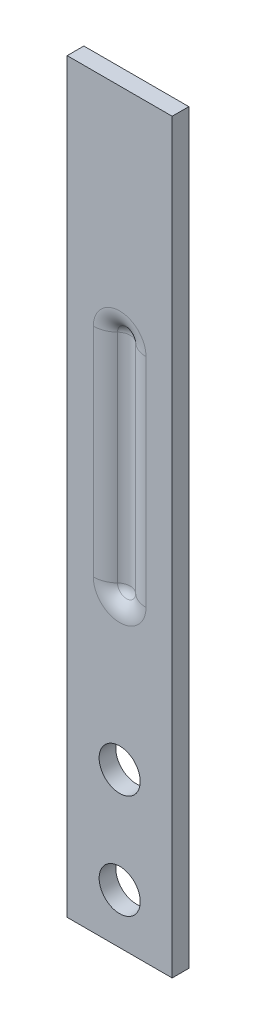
ISO-10303-21;
HEADER;
FILE_DESCRIPTION(('STEP AP214'),'2;1');
FILE_NAME('part.step','',(''),(''),'','','');
FILE_SCHEMA(('AUTOMOTIVE_DESIGN { 1 0 10303 214 1 1 1 1 }'));
ENDSEC;
DATA;
#1=APPLICATION_CONTEXT('core data for automotive mechanical design processes');
#2=APPLICATION_PROTOCOL_DEFINITION('international standard','automotive_design',2000,#1);
#3=PRODUCT_CONTEXT('',#1,'mechanical');
#4=PRODUCT('Part','Part','',(#3));
#5=PRODUCT_RELATED_PRODUCT_CATEGORY('part','',(#4));
#6=PRODUCT_DEFINITION_FORMATION('','',#4);
#7=PRODUCT_DEFINITION_CONTEXT('part definition',#1,'design');
#8=PRODUCT_DEFINITION('design','',#6,#7);
#9=PRODUCT_DEFINITION_SHAPE('','',#8);
#10=(LENGTH_UNIT() NAMED_UNIT(*) SI_UNIT(.MILLI.,.METRE.));
#11=(NAMED_UNIT(*) PLANE_ANGLE_UNIT() SI_UNIT($,.RADIAN.));
#12=(NAMED_UNIT(*) SI_UNIT($,.STERADIAN.) SOLID_ANGLE_UNIT());
#13=UNCERTAINTY_MEASURE_WITH_UNIT(LENGTH_MEASURE(1.E-05),#10,'distance_accuracy_value','');
#14=(GEOMETRIC_REPRESENTATION_CONTEXT(3) GLOBAL_UNCERTAINTY_ASSIGNED_CONTEXT((#13)) GLOBAL_UNIT_ASSIGNED_CONTEXT((#10,
#11,#12)) REPRESENTATION_CONTEXT('',''));
#15=CARTESIAN_POINT('',(0.,0.,0.));
#16=DIRECTION('',(0.,0.,1.));
#17=DIRECTION('',(1.,0.,0.));
#18=AXIS2_PLACEMENT_3D('',#15,#16,#17);
#19=CARTESIAN_POINT('',(0.,0.,-1.524));
#20=DIRECTION('',(0.,0.,-1.));
#21=DIRECTION('',(-1.,0.,0.));
#22=AXIS2_PLACEMENT_3D('',#19,#20,#21);
#23=PLANE('',#22);
#24=DIRECTION('',(0.,1.,0.));
#25=VECTOR('',#24,1.);
#26=CARTESIAN_POINT('',(4.8006,0.,-1.524));
#27=LINE('',#26,#25);
#28=CARTESIAN_POINT('',(4.8006,-34.1249,-1.524));
#29=VERTEX_POINT('',#28);
#30=CARTESIAN_POINT('',(4.8006,34.1249,-1.524));
#31=VERTEX_POINT('',#30);
#32=EDGE_CURVE('E232',#29,#31,#27,.T.);
#33=ORIENTED_EDGE('',*,*,#32,.F.);
#34=DIRECTION('',(-1.,0.,0.));
#35=VECTOR('',#34,1.);
#36=CARTESIAN_POINT('',(0.,-34.1249,-1.524));
#37=LINE('',#36,#35);
#38=CARTESIAN_POINT('',(-4.8006,-34.1249,-1.524));
#39=VERTEX_POINT('',#38);
#40=EDGE_CURVE('E212',#39,#29,#37,.F.);
#41=ORIENTED_EDGE('',*,*,#40,.F.);
#42=DIRECTION('',(0.,1.,0.));
#43=VECTOR('',#42,1.);
#44=CARTESIAN_POINT('',(-4.8006,0.,-1.524));
#45=LINE('',#44,#43);
#46=CARTESIAN_POINT('',(-4.8006,34.1249,-1.524));
#47=VERTEX_POINT('',#46);
#48=EDGE_CURVE('E238',#47,#39,#45,.F.);
#49=ORIENTED_EDGE('',*,*,#48,.F.);
#50=DIRECTION('',(-1.,0.,0.));
#51=VECTOR('',#50,1.);
#52=CARTESIAN_POINT('',(0.,34.1249,-1.524));
#53=LINE('',#52,#51);
#54=EDGE_CURVE('E235',#31,#47,#53,.T.);
#55=ORIENTED_EDGE('',*,*,#54,.F.);
#56=EDGE_LOOP('',(#33,#41,#49,#55));
#57=FACE_BOUND('',#56,.T.);
#58=CARTESIAN_POINT('',(0.,-29.5529,-1.524));
#59=DIRECTION('',(0.,0.,1.));
#60=DIRECTION('',(1.,0.,0.));
#61=AXIS2_PLACEMENT_3D('',#58,#59,#60);
#62=CIRCLE('',#61,1.8796);
#63=CARTESIAN_POINT('',(1.8796,-29.5529,-1.524));
#64=VERTEX_POINT('',#63);
#65=EDGE_CURVE('E229',#64,#64,#62,.T.);
#66=ORIENTED_EDGE('',*,*,#65,.T.);
#67=EDGE_LOOP('',(#66));
#68=FACE_BOUND('',#67,.T.);
#69=CARTESIAN_POINT('',(0.,-20.0279,-1.524));
#70=DIRECTION('',(0.,0.,1.));
#71=DIRECTION('',(1.,0.,0.));
#72=AXIS2_PLACEMENT_3D('',#69,#70,#71);
#73=CIRCLE('',#72,1.8796);
#74=CARTESIAN_POINT('',(1.8796,-20.0279,-1.524));
#75=VERTEX_POINT('',#74);
#76=EDGE_CURVE('E198',#75,#75,#73,.T.);
#77=ORIENTED_EDGE('',*,*,#76,.T.);
#78=EDGE_LOOP('',(#77));
#79=FACE_BOUND('',#78,.T.);
#80=CARTESIAN_POINT('',(0.,13.8938,-1.52399999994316));
#81=DIRECTION('',(0.,0.,-1.));
#82=DIRECTION('',(-1.,0.,0.));
#83=AXIS2_PLACEMENT_3D('',#80,#81,#82);
#84=CIRCLE('',#83,2.40995676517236);
#85=CARTESIAN_POINT('',(2.40995676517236,13.8938,-1.52399999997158));
#86=VERTEX_POINT('',#85);
#87=CARTESIAN_POINT('',(-2.40995676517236,13.8938,-1.52399999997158));
#88=VERTEX_POINT('',#87);
#89=EDGE_CURVE('E62',#86,#88,#84,.F.);
#90=ORIENTED_EDGE('',*,*,#89,.T.);
#91=DIRECTION('',(0.,-1.,0.));
#92=VECTOR('',#91,1.);
#93=CARTESIAN_POINT('',(-2.40995676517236,16.4455836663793,-1.52399999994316));
#94=LINE('',#93,#92);
#95=CARTESIAN_POINT('',(-2.40995676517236,-5.96899999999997,-1.524));
#96=VERTEX_POINT('',#95);
#97=EDGE_CURVE('E57',#88,#96,#94,.T.);
#98=ORIENTED_EDGE('',*,*,#97,.T.);
#99=CARTESIAN_POINT('',(0.,-5.96899999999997,-1.52399999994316));
#100=DIRECTION('',(0.,0.,-1.));
#101=DIRECTION('',(-1.,0.,0.));
#102=AXIS2_PLACEMENT_3D('',#99,#100,#101);
#103=CIRCLE('',#102,2.40995676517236);
#104=CARTESIAN_POINT('',(2.40995676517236,-5.96899999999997,-1.52399999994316));
#105=VERTEX_POINT('',#104);
#106=EDGE_CURVE('E157',#96,#105,#103,.F.);
#107=ORIENTED_EDGE('',*,*,#106,.T.);
#108=DIRECTION('',(0.,-1.,0.));
#109=VECTOR('',#108,1.);
#110=CARTESIAN_POINT('',(2.40995676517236,16.4455836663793,-1.52399999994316));
#111=LINE('',#110,#109);
#112=EDGE_CURVE('E155',#105,#86,#111,.F.);
#113=ORIENTED_EDGE('',*,*,#112,.T.);
#114=EDGE_LOOP('',(#90,#98,#107,#113));
#115=FACE_BOUND('',#114,.T.);
#116=ADVANCED_FACE('F41',(#57,#68,#79,#115),#23,.T.);
#117=CARTESIAN_POINT('',(-4.8006,-34.1249,0.));
#118=DIRECTION('',(1.,0.,0.));
#119=DIRECTION('',(0.,-1.,0.));
#120=AXIS2_PLACEMENT_3D('',#117,#118,#119);
#121=PLANE('',#120);
#122=DIRECTION('',(0.,0.,1.));
#123=VECTOR('',#122,1.);
#124=CARTESIAN_POINT('',(-4.8006,34.1249,0.));
#125=LINE('',#124,#123);
#126=CARTESIAN_POINT('',(-4.8006,34.1249,0.));
#127=VERTEX_POINT('',#126);
#128=EDGE_CURVE('E11',#47,#127,#125,.T.);
#129=ORIENTED_EDGE('',*,*,#128,.F.);
#130=ORIENTED_EDGE('',*,*,#48,.T.);
#131=DIRECTION('',(0.,0.,1.));
#132=VECTOR('',#131,1.);
#133=CARTESIAN_POINT('',(-4.8006,-34.1249,0.));
#134=LINE('',#133,#132);
#135=CARTESIAN_POINT('',(-4.8006,-34.1249,0.));
#136=VERTEX_POINT('',#135);
#137=EDGE_CURVE('E50',#39,#136,#134,.T.);
#138=ORIENTED_EDGE('',*,*,#137,.T.);
#139=DIRECTION('',(0.,-1.,0.));
#140=VECTOR('',#139,1.);
#141=CARTESIAN_POINT('',(-4.8006,-34.1249,0.));
#142=LINE('',#141,#140);
#143=EDGE_CURVE('E221',#127,#136,#142,.T.);
#144=ORIENTED_EDGE('',*,*,#143,.F.);
#145=EDGE_LOOP('',(#129,#130,#138,#144));
#146=FACE_BOUND('',#145,.T.);
#147=ADVANCED_FACE('F247',(#146),#121,.F.);
#148=CARTESIAN_POINT('',(-4.8006,-34.1249,0.));
#149=DIRECTION('',(0.,1.,0.));
#150=DIRECTION('',(1.,0.,0.));
#151=AXIS2_PLACEMENT_3D('',#148,#149,#150);
#152=PLANE('',#151);
#153=ORIENTED_EDGE('',*,*,#137,.F.);
#154=ORIENTED_EDGE('',*,*,#40,.T.);
#155=DIRECTION('',(0.,0.,1.));
#156=VECTOR('',#155,1.);
#157=CARTESIAN_POINT('',(4.8006,-34.1249,0.));
#158=LINE('',#157,#156);
#159=CARTESIAN_POINT('',(4.8006,-34.1249,0.));
#160=VERTEX_POINT('',#159);
#161=EDGE_CURVE('E243',#29,#160,#158,.T.);
#162=ORIENTED_EDGE('',*,*,#161,.T.);
#163=DIRECTION('',(1.,0.,0.));
#164=VECTOR('',#163,1.);
#165=CARTESIAN_POINT('',(-4.8006,-34.1249,0.));
#166=LINE('',#165,#164);
#167=EDGE_CURVE('E224',#136,#160,#166,.T.);
#168=ORIENTED_EDGE('',*,*,#167,.F.);
#169=EDGE_LOOP('',(#153,#154,#162,#168));
#170=FACE_BOUND('',#169,.T.);
#171=ADVANCED_FACE('F255',(#170),#152,.F.);
#172=CARTESIAN_POINT('',(4.8006,-34.1249,0.));
#173=DIRECTION('',(-1.,0.,0.));
#174=DIRECTION('',(0.,1.,0.));
#175=AXIS2_PLACEMENT_3D('',#172,#173,#174);
#176=PLANE('',#175);
#177=ORIENTED_EDGE('',*,*,#161,.F.);
#178=ORIENTED_EDGE('',*,*,#32,.T.);
#179=DIRECTION('',(0.,0.,1.));
#180=VECTOR('',#179,1.);
#181=CARTESIAN_POINT('',(4.8006,34.1249,0.));
#182=LINE('',#181,#180);
#183=CARTESIAN_POINT('',(4.8006,34.1249,0.));
#184=VERTEX_POINT('',#183);
#185=EDGE_CURVE('E45',#31,#184,#182,.T.);
#186=ORIENTED_EDGE('',*,*,#185,.T.);
#187=DIRECTION('',(0.,1.,0.));
#188=VECTOR('',#187,1.);
#189=CARTESIAN_POINT('',(4.8006,-34.1249,0.));
#190=LINE('',#189,#188);
#191=EDGE_CURVE('E215',#160,#184,#190,.T.);
#192=ORIENTED_EDGE('',*,*,#191,.F.);
#193=EDGE_LOOP('',(#177,#178,#186,#192));
#194=FACE_BOUND('',#193,.T.);
#195=ADVANCED_FACE('F259',(#194),#176,.F.);
#196=CARTESIAN_POINT('',(0.,-20.0279,0.));
#197=DIRECTION('',(0.,0.,1.));
#198=DIRECTION('',(1.,0.,0.));
#199=AXIS2_PLACEMENT_3D('',#196,#197,#198);
#200=CYLINDRICAL_SURFACE('',#199,1.8796);
#201=CARTESIAN_POINT('',(0.,-20.0279,0.));
#202=DIRECTION('',(0.,0.,1.));
#203=DIRECTION('',(1.,0.,0.));
#204=AXIS2_PLACEMENT_3D('',#201,#202,#203);
#205=CIRCLE('',#204,1.8796);
#206=CARTESIAN_POINT('',(1.8796,-20.0279,0.));
#207=VERTEX_POINT('',#206);
#208=EDGE_CURVE('E208',#207,#207,#205,.T.);
#209=ORIENTED_EDGE('',*,*,#208,.T.);
#210=EDGE_LOOP('',(#209));
#211=FACE_BOUND('',#210,.T.);
#212=ORIENTED_EDGE('',*,*,#76,.F.);
#213=EDGE_LOOP('',(#212));
#214=FACE_BOUND('',#213,.T.);
#215=ADVANCED_FACE('F270',(#211,#214),#200,.F.);
#216=CARTESIAN_POINT('',(0.,-29.5529,0.));
#217=DIRECTION('',(0.,0.,1.));
#218=DIRECTION('',(1.,0.,0.));
#219=AXIS2_PLACEMENT_3D('',#216,#217,#218);
#220=CYLINDRICAL_SURFACE('',#219,1.8796);
#221=CARTESIAN_POINT('',(0.,-29.5529,0.));
#222=DIRECTION('',(0.,0.,1.));
#223=DIRECTION('',(1.,0.,0.));
#224=AXIS2_PLACEMENT_3D('',#221,#222,#223);
#225=CIRCLE('',#224,1.8796);
#226=CARTESIAN_POINT('',(1.8796,-29.5529,0.));
#227=VERTEX_POINT('',#226);
#228=EDGE_CURVE('E211',#227,#227,#225,.T.);
#229=ORIENTED_EDGE('',*,*,#228,.T.);
#230=EDGE_LOOP('',(#229));
#231=FACE_BOUND('',#230,.T.);
#232=ORIENTED_EDGE('',*,*,#65,.F.);
#233=EDGE_LOOP('',(#232));
#234=FACE_BOUND('',#233,.T.);
#235=ADVANCED_FACE('F272',(#231,#234),#220,.F.);
#236=CARTESIAN_POINT('',(-4.8006,34.1249,0.));
#237=DIRECTION('',(0.,-1.,0.));
#238=DIRECTION('',(-1.,0.,0.));
#239=AXIS2_PLACEMENT_3D('',#236,#237,#238);
#240=PLANE('',#239);
#241=ORIENTED_EDGE('',*,*,#54,.T.);
#242=ORIENTED_EDGE('',*,*,#128,.T.);
#243=DIRECTION('',(-1.,0.,0.));
#244=VECTOR('',#243,1.);
#245=CARTESIAN_POINT('',(-4.8006,34.1249,0.));
#246=LINE('',#245,#244);
#247=EDGE_CURVE('E218',#184,#127,#246,.T.);
#248=ORIENTED_EDGE('',*,*,#247,.F.);
#249=ORIENTED_EDGE('',*,*,#185,.F.);
#250=EDGE_LOOP('',(#241,#242,#248,#249));
#251=FACE_BOUND('',#250,.T.);
#252=ADVANCED_FACE('F43',(#251),#240,.F.);
#253=CARTESIAN_POINT('',(0.,0.,0.));
#254=DIRECTION('',(0.,0.,-1.));
#255=DIRECTION('',(-1.,0.,0.));
#256=AXIS2_PLACEMENT_3D('',#253,#254,#255);
#257=PLANE('',#256);
#258=CARTESIAN_POINT('',(0.,13.8938,5.6843418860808E-11));
#259=DIRECTION('',(0.,0.,-1.));
#260=DIRECTION('',(0.,-1.,0.));
#261=AXIS2_PLACEMENT_3D('',#258,#259,#260);
#262=CIRCLE('',#261,2.40995676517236);
#263=CARTESIAN_POINT('',(2.40995676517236,13.8938,5.6843418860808E-11));
#264=VERTEX_POINT('',#263);
#265=CARTESIAN_POINT('',(-2.40995676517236,13.8938,2.8421709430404E-11));
#266=VERTEX_POINT('',#265);
#267=EDGE_CURVE('E184',#264,#266,#262,.F.);
#268=ORIENTED_EDGE('',*,*,#267,.F.);
#269=DIRECTION('',(0.,-1.,0.));
#270=VECTOR('',#269,1.);
#271=CARTESIAN_POINT('',(2.40995676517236,73.9624,5.6843418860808E-11));
#272=LINE('',#271,#270);
#273=CARTESIAN_POINT('',(2.40995676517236,-5.96899999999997,5.68432020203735E-11));
#274=VERTEX_POINT('',#273);
#275=EDGE_CURVE('E180',#274,#264,#272,.F.);
#276=ORIENTED_EDGE('',*,*,#275,.F.);
#277=CARTESIAN_POINT('',(0.,-5.96899999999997,5.6843418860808E-11));
#278=DIRECTION('',(0.,0.,-1.));
#279=DIRECTION('',(0.,-1.,0.));
#280=AXIS2_PLACEMENT_3D('',#277,#278,#279);
#281=CIRCLE('',#280,2.40995676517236);
#282=CARTESIAN_POINT('',(-2.40995676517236,-5.96899999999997,5.6843418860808E-11));
#283=VERTEX_POINT('',#282);
#284=EDGE_CURVE('E182',#283,#274,#281,.F.);
#285=ORIENTED_EDGE('',*,*,#284,.F.);
#286=DIRECTION('',(0.,-1.,0.));
#287=VECTOR('',#286,1.);
#288=CARTESIAN_POINT('',(-2.40995676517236,73.9624,5.6843418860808E-11));
#289=LINE('',#288,#287);
#290=EDGE_CURVE('E187',#266,#283,#289,.T.);
#291=ORIENTED_EDGE('',*,*,#290,.F.);
#292=EDGE_LOOP('',(#268,#276,#285,#291));
#293=FACE_BOUND('',#292,.T.);
#294=ORIENTED_EDGE('',*,*,#208,.F.);
#295=EDGE_LOOP('',(#294));
#296=FACE_BOUND('',#295,.T.);
#297=ORIENTED_EDGE('',*,*,#228,.F.);
#298=EDGE_LOOP('',(#297));
#299=FACE_BOUND('',#298,.T.);
#300=ORIENTED_EDGE('',*,*,#191,.T.);
#301=ORIENTED_EDGE('',*,*,#247,.T.);
#302=ORIENTED_EDGE('',*,*,#143,.T.);
#303=ORIENTED_EDGE('',*,*,#167,.T.);
#304=EDGE_LOOP('',(#300,#301,#302,#303));
#305=FACE_BOUND('',#304,.T.);
#306=ADVANCED_FACE('F253',(#293,#296,#299,#305),#257,.F.);
#307=CARTESIAN_POINT('',(0.,16.4455836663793,0.240046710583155));
#308=DIRECTION('',(0.,-1.,0.));
#309=DIRECTION('',(1.,0.,0.));
#310=AXIS2_PLACEMENT_3D('',#307,#308,#309);
#311=CYLINDRICAL_SURFACE('',#310,1.20524671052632);
#312=CARTESIAN_POINT('',(0.,-5.96899999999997,0.240046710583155));
#313=DIRECTION('',(0.,1.,0.));
#314=DIRECTION('',(-1.,0.,0.));
#315=AXIS2_PLACEMENT_3D('',#312,#313,#314);
#316=CIRCLE('',#315,1.20524671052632);
#317=CARTESIAN_POINT('',(0.831964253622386,-5.96899999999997,-0.631994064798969));
#318=VERTEX_POINT('',#317);
#319=CARTESIAN_POINT('',(-0.83196425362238,-5.96899999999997,-0.631994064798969));
#320=VERTEX_POINT('',#319);
#321=EDGE_CURVE('E173',#318,#320,#316,.T.);
#322=ORIENTED_EDGE('',*,*,#321,.F.);
#323=DIRECTION('',(0.,-1.,0.));
#324=VECTOR('',#323,1.);
#325=CARTESIAN_POINT('',(0.831964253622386,16.4455836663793,-0.631994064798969));
#326=LINE('',#325,#324);
#327=CARTESIAN_POINT('',(0.831964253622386,13.8938,-0.631994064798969));
#328=VERTEX_POINT('',#327);
#329=EDGE_CURVE('E189',#328,#318,#326,.T.);
#330=ORIENTED_EDGE('',*,*,#329,.F.);
#331=CARTESIAN_POINT('',(0.,13.8938,0.240046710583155));
#332=DIRECTION('',(0.,1.,0.));
#333=DIRECTION('',(-1.,0.,0.));
#334=AXIS2_PLACEMENT_3D('',#331,#332,#333);
#335=CIRCLE('',#334,1.20524671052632);
#336=CARTESIAN_POINT('',(-0.831964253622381,13.8938,-0.631994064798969));
#337=VERTEX_POINT('',#336);
#338=EDGE_CURVE('E176',#328,#337,#335,.T.);
#339=ORIENTED_EDGE('',*,*,#338,.T.);
#340=DIRECTION('',(0.,-1.,0.));
#341=VECTOR('',#340,1.);
#342=CARTESIAN_POINT('',(-0.831964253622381,16.4455836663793,-0.631994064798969));
#343=LINE('',#342,#341);
#344=EDGE_CURVE('E191',#320,#337,#343,.F.);
#345=ORIENTED_EDGE('',*,*,#344,.F.);
#346=EDGE_LOOP('',(#322,#330,#339,#345));
#347=FACE_BOUND('',#346,.T.);
#348=ADVANCED_FACE('F333',(#347),#311,.F.);
#349=CARTESIAN_POINT('',(0.,13.8938,0.240046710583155));
#350=DIRECTION('',(0.,0.,-1.));
#351=DIRECTION('',(-1.,0.,0.));
#352=AXIS2_PLACEMENT_3D('',#349,#350,#351);
#353=SPHERICAL_SURFACE('',#352,1.20524671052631);
#354=ORIENTED_EDGE('',*,*,#338,.F.);
#355=CARTESIAN_POINT('',(0.,13.8938,-0.631994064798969));
#356=DIRECTION('',(0.,0.,1.));
#357=DIRECTION('',(0.,1.,0.));
#358=AXIS2_PLACEMENT_3D('',#355,#356,#357);
#359=CIRCLE('',#358,0.831964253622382);
#360=EDGE_CURVE('E194',#337,#328,#359,.F.);
#361=ORIENTED_EDGE('',*,*,#360,.F.);
#362=EDGE_LOOP('',(#354,#361));
#363=FACE_BOUND('',#362,.T.);
#364=ADVANCED_FACE('F343',(#363),#353,.F.);
#365=CARTESIAN_POINT('',(0.,-5.96899999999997,0.240046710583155));
#366=DIRECTION('',(0.,0.,1.));
#367=DIRECTION('',(-1.,0.,0.));
#368=AXIS2_PLACEMENT_3D('',#365,#366,#367);
#369=SPHERICAL_SURFACE('',#368,1.20524671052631);
#370=ORIENTED_EDGE('',*,*,#321,.T.);
#371=CARTESIAN_POINT('',(0.,-5.96899999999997,-0.631994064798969));
#372=DIRECTION('',(0.,0.,1.));
#373=DIRECTION('',(0.,1.,0.));
#374=AXIS2_PLACEMENT_3D('',#371,#372,#373);
#375=CIRCLE('',#374,0.831964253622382);
#376=EDGE_CURVE('E196',#318,#320,#375,.F.);
#377=ORIENTED_EDGE('',*,*,#376,.F.);
#378=EDGE_LOOP('',(#370,#377));
#379=FACE_BOUND('',#378,.T.);
#380=ADVANCED_FACE('F353',(#379),#369,.F.);
#381=CARTESIAN_POINT('',(2.40995676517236,16.4455836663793,-2.28599999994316));
#382=DIRECTION('',(0.,-1.,0.));
#383=DIRECTION('',(1.,0.,0.));
#384=AXIS2_PLACEMENT_3D('',#381,#382,#383);
#385=CYLINDRICAL_SURFACE('',#384,2.286);
#386=CARTESIAN_POINT('',(2.40995676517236,-5.96899999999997,-2.28599999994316));
#387=DIRECTION('',(0.,1.,0.));
#388=DIRECTION('',(-1.,0.,0.));
#389=AXIS2_PLACEMENT_3D('',#386,#387,#388);
#390=CIRCLE('',#389,2.286);
#391=EDGE_CURVE('E203',#318,#274,#390,.T.);
#392=ORIENTED_EDGE('',*,*,#391,.T.);
#393=ORIENTED_EDGE('',*,*,#275,.T.);
#394=CARTESIAN_POINT('',(2.40995676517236,13.8938,-2.28599999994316));
#395=DIRECTION('',(0.,-1.,0.));
#396=DIRECTION('',(1.,0.,0.));
#397=AXIS2_PLACEMENT_3D('',#394,#395,#396);
#398=CIRCLE('',#397,2.286);
#399=EDGE_CURVE('E177',#264,#328,#398,.T.);
#400=ORIENTED_EDGE('',*,*,#399,.T.);
#401=ORIENTED_EDGE('',*,*,#329,.T.);
#402=EDGE_LOOP('',(#392,#393,#400,#401));
#403=FACE_BOUND('',#402,.T.);
#404=ADVANCED_FACE('F363',(#403),#385,.T.);
#405=CARTESIAN_POINT('',(0.,13.8938,-2.28599999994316));
#406=DIRECTION('',(0.,0.,-1.));
#407=DIRECTION('',(0.,-1.,0.));
#408=AXIS2_PLACEMENT_3D('',#405,#406,#407);
#409=TOROIDAL_SURFACE('',#408,2.40995676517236,2.286);
#410=ORIENTED_EDGE('',*,*,#399,.F.);
#411=ORIENTED_EDGE('',*,*,#267,.T.);
#412=CARTESIAN_POINT('',(-2.40995676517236,13.8938,-2.28599999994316));
#413=DIRECTION('',(0.,1.,0.));
#414=DIRECTION('',(-1.,0.,0.));
#415=AXIS2_PLACEMENT_3D('',#412,#413,#414);
#416=CIRCLE('',#415,2.286);
#417=EDGE_CURVE('E201',#266,#337,#416,.T.);
#418=ORIENTED_EDGE('',*,*,#417,.T.);
#419=ORIENTED_EDGE('',*,*,#360,.T.);
#420=EDGE_LOOP('',(#410,#411,#418,#419));
#421=FACE_BOUND('',#420,.T.);
#422=ADVANCED_FACE('F373',(#421),#409,.T.);
#423=CARTESIAN_POINT('',(0.,-5.96899999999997,-2.28599999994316));
#424=DIRECTION('',(0.,0.,-1.));
#425=DIRECTION('',(0.,-1.,0.));
#426=AXIS2_PLACEMENT_3D('',#423,#424,#425);
#427=TOROIDAL_SURFACE('',#426,2.40995676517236,2.286);
#428=ORIENTED_EDGE('',*,*,#391,.F.);
#429=ORIENTED_EDGE('',*,*,#376,.T.);
#430=CARTESIAN_POINT('',(-2.40995676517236,-5.96899999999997,-2.28599999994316));
#431=DIRECTION('',(0.,-1.,0.));
#432=DIRECTION('',(1.,0.,0.));
#433=AXIS2_PLACEMENT_3D('',#430,#431,#432);
#434=CIRCLE('',#433,2.286);
#435=EDGE_CURVE('E171',#320,#283,#434,.T.);
#436=ORIENTED_EDGE('',*,*,#435,.T.);
#437=ORIENTED_EDGE('',*,*,#284,.T.);
#438=EDGE_LOOP('',(#428,#429,#436,#437));
#439=FACE_BOUND('',#438,.T.);
#440=ADVANCED_FACE('F384',(#439),#427,.T.);
#441=CARTESIAN_POINT('',(-2.40995676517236,16.4455836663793,-2.28599999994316));
#442=DIRECTION('',(0.,-1.,0.));
#443=DIRECTION('',(1.,0.,0.));
#444=AXIS2_PLACEMENT_3D('',#441,#442,#443);
#445=CYLINDRICAL_SURFACE('',#444,2.286);
#446=ORIENTED_EDGE('',*,*,#417,.F.);
#447=ORIENTED_EDGE('',*,*,#290,.T.);
#448=ORIENTED_EDGE('',*,*,#435,.F.);
#449=ORIENTED_EDGE('',*,*,#344,.T.);
#450=EDGE_LOOP('',(#446,#447,#448,#449));
#451=FACE_BOUND('',#450,.T.);
#452=ADVANCED_FACE('F395',(#451),#445,.T.);
#453=CARTESIAN_POINT('',(-2.40995676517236,16.4455836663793,-2.28599999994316));
#454=DIRECTION('',(0.,-1.,0.));
#455=DIRECTION('',(1.,0.,0.));
#456=AXIS2_PLACEMENT_3D('',#453,#454,#455);
#457=CYLINDRICAL_SURFACE('',#456,0.762);
#458=CARTESIAN_POINT('',(-2.40995676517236,13.8938,-2.28599999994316));
#459=DIRECTION('',(0.,-1.,0.));
#460=DIRECTION('',(0.,0.,-1.));
#461=AXIS2_PLACEMENT_3D('',#458,#459,#460);
#462=CIRCLE('',#461,0.762);
#463=CARTESIAN_POINT('',(-1.88395926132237,13.8938,-1.73466468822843));
#464=VERTEX_POINT('',#463);
#465=EDGE_CURVE('E143',#88,#464,#462,.F.);
#466=ORIENTED_EDGE('',*,*,#465,.T.);
#467=DIRECTION('',(0.,-1.,0.));
#468=VECTOR('',#467,1.);
#469=CARTESIAN_POINT('',(-1.88395926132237,16.4455836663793,-1.73466468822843));
#470=LINE('',#469,#468);
#471=CARTESIAN_POINT('',(-1.88395926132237,-5.96899999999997,-1.73466468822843));
#472=VERTEX_POINT('',#471);
#473=EDGE_CURVE('E138',#472,#464,#470,.F.);
#474=ORIENTED_EDGE('',*,*,#473,.F.);
#475=CARTESIAN_POINT('',(-2.40995676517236,-5.96899999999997,-2.28599999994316));
#476=DIRECTION('',(0.,-1.,0.));
#477=DIRECTION('',(0.,0.,-1.));
#478=AXIS2_PLACEMENT_3D('',#475,#476,#477);
#479=CIRCLE('',#478,0.762);
#480=EDGE_CURVE('E161',#472,#96,#479,.T.);
#481=ORIENTED_EDGE('',*,*,#480,.T.);
#482=ORIENTED_EDGE('',*,*,#97,.F.);
#483=EDGE_LOOP('',(#466,#474,#481,#482));
#484=FACE_BOUND('',#483,.T.);
#485=ADVANCED_FACE('F154',(#484),#457,.F.);
#486=CARTESIAN_POINT('',(0.,-5.96899999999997,-2.28599999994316));
#487=DIRECTION('',(0.,0.,-1.));
#488=DIRECTION('',(0.,-1.,0.));
#489=AXIS2_PLACEMENT_3D('',#486,#487,#488);
#490=TOROIDAL_SURFACE('',#489,2.40995676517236,0.762);
#491=CARTESIAN_POINT('',(2.40995676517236,-5.96899999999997,-2.28599999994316));
#492=DIRECTION('',(0.,1.,0.));
#493=DIRECTION('',(-1.,0.,0.));
#494=AXIS2_PLACEMENT_3D('',#491,#492,#493);
#495=CIRCLE('',#494,0.762);
#496=CARTESIAN_POINT('',(1.88395926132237,-5.96899999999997,-1.73466468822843));
#497=VERTEX_POINT('',#496);
#498=EDGE_CURVE('E163',#497,#105,#495,.T.);
#499=ORIENTED_EDGE('',*,*,#498,.T.);
#500=ORIENTED_EDGE('',*,*,#106,.F.);
#501=ORIENTED_EDGE('',*,*,#480,.F.);
#502=CARTESIAN_POINT('',(0.,-5.96899999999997,-1.73466468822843));
#503=DIRECTION('',(0.,0.,1.));
#504=DIRECTION('',(1.,0.,0.));
#505=AXIS2_PLACEMENT_3D('',#502,#503,#504);
#506=CIRCLE('',#505,1.88395926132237);
#507=EDGE_CURVE('E146',#497,#472,#506,.F.);
#508=ORIENTED_EDGE('',*,*,#507,.F.);
#509=EDGE_LOOP('',(#499,#500,#501,#508));
#510=FACE_BOUND('',#509,.T.);
#511=ADVANCED_FACE('F414',(#510),#490,.F.);
#512=CARTESIAN_POINT('',(0.,13.8938,-2.28599999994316));
#513=DIRECTION('',(0.,0.,-1.));
#514=DIRECTION('',(0.,-1.,0.));
#515=AXIS2_PLACEMENT_3D('',#512,#513,#514);
#516=TOROIDAL_SURFACE('',#515,2.40995676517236,0.762);
#517=CARTESIAN_POINT('',(2.40995676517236,13.8938,-2.28599999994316));
#518=DIRECTION('',(0.,1.,0.));
#519=DIRECTION('',(-1.,0.,0.));
#520=AXIS2_PLACEMENT_3D('',#517,#518,#519);
#521=CIRCLE('',#520,0.762);
#522=CARTESIAN_POINT('',(1.88395926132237,13.8938,-1.73466468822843));
#523=VERTEX_POINT('',#522);
#524=EDGE_CURVE('E145',#86,#523,#521,.F.);
#525=ORIENTED_EDGE('',*,*,#524,.T.);
#526=CARTESIAN_POINT('',(0.,13.8938,-1.73466468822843));
#527=DIRECTION('',(0.,0.,-1.));
#528=DIRECTION('',(-1.,0.,0.));
#529=AXIS2_PLACEMENT_3D('',#526,#527,#528);
#530=CIRCLE('',#529,1.88395926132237);
#531=EDGE_CURVE('E131',#464,#523,#530,.T.);
#532=ORIENTED_EDGE('',*,*,#531,.F.);
#533=ORIENTED_EDGE('',*,*,#465,.F.);
#534=ORIENTED_EDGE('',*,*,#89,.F.);
#535=EDGE_LOOP('',(#525,#532,#533,#534));
#536=FACE_BOUND('',#535,.T.);
#537=ADVANCED_FACE('F141',(#536),#516,.F.);
#538=CARTESIAN_POINT('',(2.40995676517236,16.4455836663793,-2.28599999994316));
#539=DIRECTION('',(0.,-1.,0.));
#540=DIRECTION('',(1.,0.,0.));
#541=AXIS2_PLACEMENT_3D('',#538,#539,#540);
#542=CYLINDRICAL_SURFACE('',#541,0.762);
#543=ORIENTED_EDGE('',*,*,#498,.F.);
#544=DIRECTION('',(0.,-1.,0.));
#545=VECTOR('',#544,1.);
#546=CARTESIAN_POINT('',(1.88395926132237,16.4455836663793,-1.73466468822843));
#547=LINE('',#546,#545);
#548=EDGE_CURVE('E137',#523,#497,#547,.T.);
#549=ORIENTED_EDGE('',*,*,#548,.F.);
#550=ORIENTED_EDGE('',*,*,#524,.F.);
#551=ORIENTED_EDGE('',*,*,#112,.F.);
#552=EDGE_LOOP('',(#543,#549,#550,#551));
#553=FACE_BOUND('',#552,.T.);
#554=ADVANCED_FACE('F432',(#553),#542,.F.);
#555=CARTESIAN_POINT('',(0.,-5.96899999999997,0.240046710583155));
#556=DIRECTION('',(0.,0.,1.));
#557=DIRECTION('',(-1.,0.,0.));
#558=AXIS2_PLACEMENT_3D('',#555,#556,#557);
#559=SPHERICAL_SURFACE('',#558,2.72924671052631);
#560=CARTESIAN_POINT('',(0.,-5.96899999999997,0.240046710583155));
#561=DIRECTION('',(0.,-1.,0.));
#562=DIRECTION('',(0.,0.,-1.));
#563=AXIS2_PLACEMENT_3D('',#560,#561,#562);
#564=CIRCLE('',#563,2.72924671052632);
#565=EDGE_CURVE('E150',#497,#472,#564,.F.);
#566=ORIENTED_EDGE('',*,*,#565,.F.);
#567=ORIENTED_EDGE('',*,*,#507,.T.);
#568=EDGE_LOOP('',(#566,#567));
#569=FACE_BOUND('',#568,.T.);
#570=ADVANCED_FACE('F442',(#569),#559,.T.);
#571=CARTESIAN_POINT('',(0.,13.8938,0.240046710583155));
#572=DIRECTION('',(0.,0.,-1.));
#573=DIRECTION('',(-1.,0.,0.));
#574=AXIS2_PLACEMENT_3D('',#571,#572,#573);
#575=SPHERICAL_SURFACE('',#574,2.72924671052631);
#576=CARTESIAN_POINT('',(0.,13.8938,0.240046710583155));
#577=DIRECTION('',(0.,-1.,0.));
#578=DIRECTION('',(0.,0.,-1.));
#579=AXIS2_PLACEMENT_3D('',#576,#577,#578);
#580=CIRCLE('',#579,2.72924671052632);
#581=EDGE_CURVE('E128',#523,#464,#580,.F.);
#582=ORIENTED_EDGE('',*,*,#581,.T.);
#583=ORIENTED_EDGE('',*,*,#531,.T.);
#584=EDGE_LOOP('',(#582,#583));
#585=FACE_BOUND('',#584,.T.);
#586=ADVANCED_FACE('F130',(#585),#575,.T.);
#587=CARTESIAN_POINT('',(0.,16.4455836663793,0.240046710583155));
#588=DIRECTION('',(0.,-1.,0.));
#589=DIRECTION('',(1.,0.,0.));
#590=AXIS2_PLACEMENT_3D('',#587,#588,#589);
#591=CYLINDRICAL_SURFACE('',#590,2.72924671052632);
#592=ORIENTED_EDGE('',*,*,#565,.T.);
#593=ORIENTED_EDGE('',*,*,#473,.T.);
#594=ORIENTED_EDGE('',*,*,#581,.F.);
#595=ORIENTED_EDGE('',*,*,#548,.T.);
#596=EDGE_LOOP('',(#592,#593,#594,#595));
#597=FACE_BOUND('',#596,.T.);
#598=ADVANCED_FACE('F149',(#597),#591,.T.);
#599=CLOSED_SHELL('',(#116,#147,#171,#195,#215,#235,#252,#306,#348,#364,#380,#404,#422,#440,
#452,#485,#511,#537,#554,#570,#586,#598));
#600=MANIFOLD_SOLID_BREP('B2',#599);
#601=ADVANCED_BREP_SHAPE_REPRESENTATION('',(#18,#600),#14);
#602=SHAPE_DEFINITION_REPRESENTATION(#9,#601);
ENDSEC;
END-ISO-10303-21;
